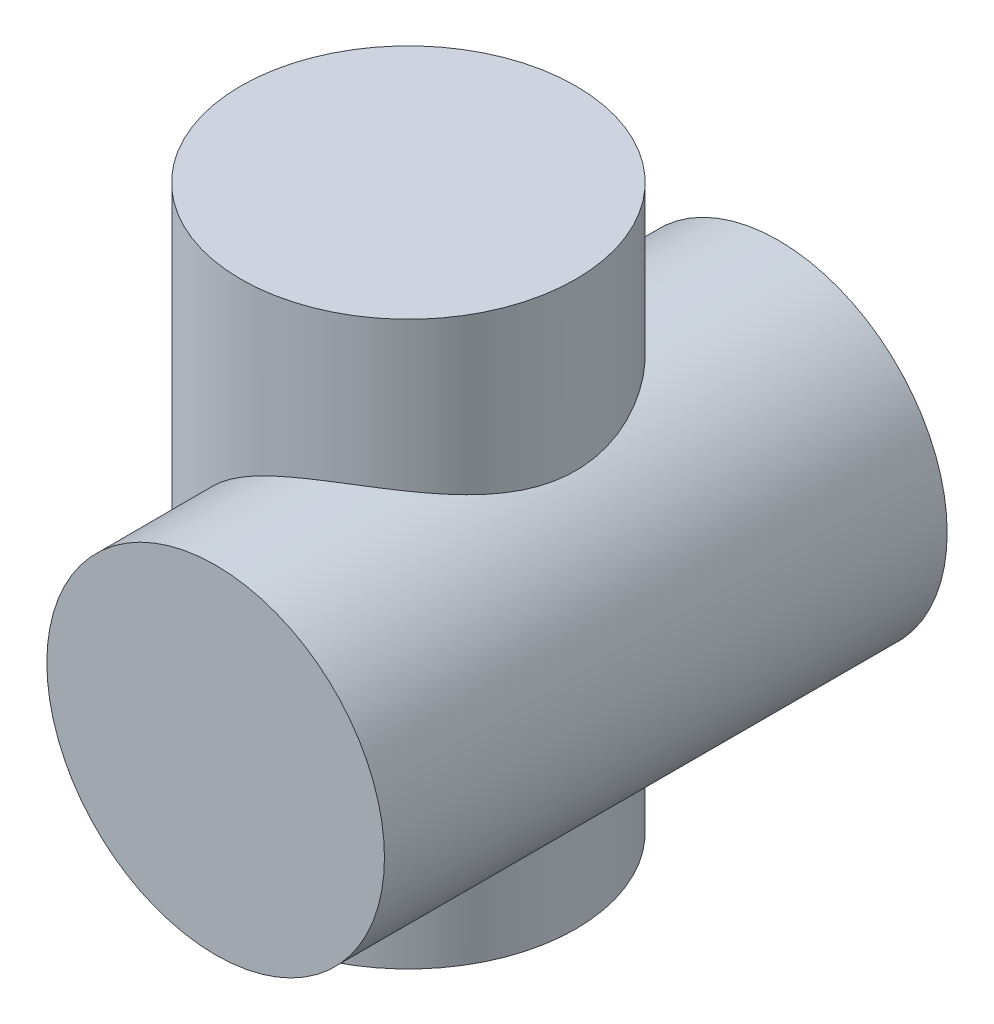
from build123d import *

# Parameters (mm, degrees)
SKETCH_1_R      = 15
EXTRUDE_1_DEPTH = 50
SKETCH_2_R      = 14.87920629
EXTRUDE_2_DEPTH = 25


with BuildPart() as part:
    # Sketch 1 → Extrude 1 (new body)
    with BuildSketch(Plane.XY):
        Circle(SKETCH_1_R)
    extrude(amount=EXTRUDE_1_DEPTH)

    # Sketch 2 → Extrude 2 (add, symmetric)
    with BuildSketch(Plane(origin=(0, 3, 0), x_dir=(-1, 0, 0), z_dir=(0, 1, 0))):
        with Locations(Location((7.876778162, 25, 0), (0, 0, 90))):
            Circle(SKETCH_2_R)
    extrude(amount=EXTRUDE_2_DEPTH, both=True)


solid = part.part
